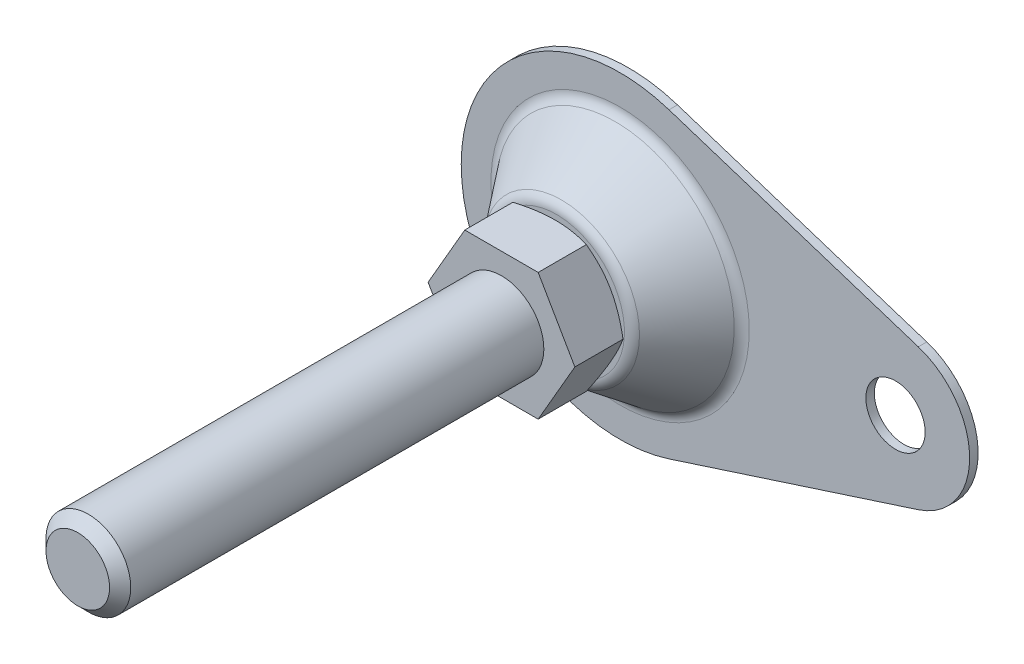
ISO-10303-21;
HEADER;
FILE_DESCRIPTION(('STEP AP214'),'2;1');
FILE_NAME('part.step','',(''),(''),'','','');
FILE_SCHEMA(('AUTOMOTIVE_DESIGN { 1 0 10303 214 1 1 1 1 }'));
ENDSEC;
DATA;
#1=APPLICATION_CONTEXT('core data for automotive mechanical design processes');
#2=APPLICATION_PROTOCOL_DEFINITION('international standard','automotive_design',2000,#1);
#3=PRODUCT_CONTEXT('',#1,'mechanical');
#4=PRODUCT('Part','Part','',(#3));
#5=PRODUCT_RELATED_PRODUCT_CATEGORY('part','',(#4));
#6=PRODUCT_DEFINITION_FORMATION('','',#4);
#7=PRODUCT_DEFINITION_CONTEXT('part definition',#1,'design');
#8=PRODUCT_DEFINITION('design','',#6,#7);
#9=PRODUCT_DEFINITION_SHAPE('','',#8);
#10=(LENGTH_UNIT() NAMED_UNIT(*) SI_UNIT(.MILLI.,.METRE.));
#11=(NAMED_UNIT(*) PLANE_ANGLE_UNIT() SI_UNIT($,.RADIAN.));
#12=(NAMED_UNIT(*) SI_UNIT($,.STERADIAN.) SOLID_ANGLE_UNIT());
#13=UNCERTAINTY_MEASURE_WITH_UNIT(LENGTH_MEASURE(1.E-05),#10,'distance_accuracy_value','');
#14=(GEOMETRIC_REPRESENTATION_CONTEXT(3) GLOBAL_UNCERTAINTY_ASSIGNED_CONTEXT((#13)) GLOBAL_UNIT_ASSIGNED_CONTEXT((#10,
#11,#12)) REPRESENTATION_CONTEXT('',''));
#15=CARTESIAN_POINT('',(0.,0.,0.));
#16=DIRECTION('',(0.,0.,1.));
#17=DIRECTION('',(1.,0.,0.));
#18=AXIS2_PLACEMENT_3D('',#15,#16,#17);
#19=CARTESIAN_POINT('',(65.,0.,2.));
#20=DIRECTION('',(0.,0.,1.));
#21=DIRECTION('',(1.,0.,0.));
#22=AXIS2_PLACEMENT_3D('',#19,#20,#21);
#23=PLANE('',#22);
#24=CARTESIAN_POINT('',(0.,0.,2.));
#25=DIRECTION('',(0.,0.,1.));
#26=DIRECTION('',(1.,0.,0.));
#27=AXIS2_PLACEMENT_3D('',#24,#25,#26);
#28=CIRCLE('',#27,30.4802116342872);
#29=CARTESIAN_POINT('',(30.4802116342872,0.,2.));
#30=VERTEX_POINT('',#29);
#31=EDGE_CURVE('E245',#30,#30,#28,.F.);
#32=ORIENTED_EDGE('',*,*,#31,.T.);
#33=EDGE_LOOP('',(#32));
#34=FACE_BOUND('',#33,.T.);
#35=CARTESIAN_POINT('',(65.,0.,2.));
#36=DIRECTION('',(0.,0.,1.));
#37=DIRECTION('',(1.,0.,0.));
#38=AXIS2_PLACEMENT_3D('',#35,#36,#37);
#39=CIRCLE('',#38,7.);
#40=CARTESIAN_POINT('',(72.,0.,2.));
#41=VERTEX_POINT('',#40);
#42=EDGE_CURVE('E262',#41,#41,#39,.T.);
#43=ORIENTED_EDGE('',*,*,#42,.F.);
#44=EDGE_LOOP('',(#43));
#45=FACE_BOUND('',#44,.T.);
#46=DIRECTION('',(-0.951485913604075,0.307692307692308,0.));
#47=VECTOR('',#46,1.);
#48=CARTESIAN_POINT('',(11.5384615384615,35.6807217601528,2.));
#49=LINE('',#48,#47);
#50=CARTESIAN_POINT('',(70.3846153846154,16.6510034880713,2.));
#51=VERTEX_POINT('',#50);
#52=CARTESIAN_POINT('',(11.5384615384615,35.6807217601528,2.));
#53=VERTEX_POINT('',#52);
#54=EDGE_CURVE('E112',#51,#53,#49,.T.);
#55=ORIENTED_EDGE('',*,*,#54,.T.);
#56=CARTESIAN_POINT('',(0.,0.,2.));
#57=DIRECTION('',(0.,0.,1.));
#58=DIRECTION('',(1.,0.,0.));
#59=AXIS2_PLACEMENT_3D('',#56,#57,#58);
#60=CIRCLE('',#59,37.5);
#61=CARTESIAN_POINT('',(11.5384615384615,-35.6807217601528,2.));
#62=VERTEX_POINT('',#61);
#63=EDGE_CURVE('E114',#53,#62,#60,.T.);
#64=ORIENTED_EDGE('',*,*,#63,.T.);
#65=DIRECTION('',(0.951485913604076,0.307692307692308,0.));
#66=VECTOR('',#65,1.);
#67=CARTESIAN_POINT('',(11.5384615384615,-35.6807217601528,2.));
#68=LINE('',#67,#66);
#69=CARTESIAN_POINT('',(70.3846153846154,-16.6510034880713,2.));
#70=VERTEX_POINT('',#69);
#71=EDGE_CURVE('E97',#62,#70,#68,.T.);
#72=ORIENTED_EDGE('',*,*,#71,.T.);
#73=CARTESIAN_POINT('',(65.,0.,2.));
#74=DIRECTION('',(0.,0.,1.));
#75=DIRECTION('',(1.,0.,0.));
#76=AXIS2_PLACEMENT_3D('',#73,#74,#75);
#77=CIRCLE('',#76,17.5);
#78=EDGE_CURVE('E106',#70,#51,#77,.T.);
#79=ORIENTED_EDGE('',*,*,#78,.T.);
#80=EDGE_LOOP('',(#55,#64,#72,#79));
#81=FACE_BOUND('',#80,.T.);
#82=ADVANCED_FACE('F14',(#34,#45,#81),#23,.T.);
#83=CARTESIAN_POINT('',(65.,0.,0.));
#84=DIRECTION('',(0.,0.,1.));
#85=DIRECTION('',(1.,0.,0.));
#86=AXIS2_PLACEMENT_3D('',#83,#84,#85);
#87=PLANE('',#86);
#88=CARTESIAN_POINT('',(65.,0.,0.));
#89=DIRECTION('',(0.,0.,1.));
#90=DIRECTION('',(1.,0.,0.));
#91=AXIS2_PLACEMENT_3D('',#88,#89,#90);
#92=CIRCLE('',#91,7.);
#93=CARTESIAN_POINT('',(72.,0.,0.));
#94=VERTEX_POINT('',#93);
#95=EDGE_CURVE('E258',#94,#94,#92,.T.);
#96=ORIENTED_EDGE('',*,*,#95,.T.);
#97=EDGE_LOOP('',(#96));
#98=FACE_BOUND('',#97,.T.);
#99=CARTESIAN_POINT('',(0.,0.,0.));
#100=DIRECTION('',(0.,0.,1.));
#101=DIRECTION('',(1.,0.,0.));
#102=AXIS2_PLACEMENT_3D('',#99,#100,#101);
#103=CIRCLE('',#102,37.5);
#104=CARTESIAN_POINT('',(11.5384615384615,35.6807217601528,0.));
#105=VERTEX_POINT('',#104);
#106=CARTESIAN_POINT('',(11.5384615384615,-35.6807217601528,0.));
#107=VERTEX_POINT('',#106);
#108=EDGE_CURVE('E275',#105,#107,#103,.T.);
#109=ORIENTED_EDGE('',*,*,#108,.F.);
#110=DIRECTION('',(-0.951485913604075,0.307692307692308,0.));
#111=VECTOR('',#110,1.);
#112=CARTESIAN_POINT('',(70.3846153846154,16.6510034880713,0.));
#113=LINE('',#112,#111);
#114=CARTESIAN_POINT('',(70.3846153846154,16.6510034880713,0.));
#115=VERTEX_POINT('',#114);
#116=EDGE_CURVE('E9',#115,#105,#113,.T.);
#117=ORIENTED_EDGE('',*,*,#116,.F.);
#118=CARTESIAN_POINT('',(65.,0.,0.));
#119=DIRECTION('',(0.,0.,1.));
#120=DIRECTION('',(1.,0.,0.));
#121=AXIS2_PLACEMENT_3D('',#118,#119,#120);
#122=CIRCLE('',#121,17.5);
#123=CARTESIAN_POINT('',(70.3846153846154,-16.6510034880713,0.));
#124=VERTEX_POINT('',#123);
#125=EDGE_CURVE('E22',#124,#115,#122,.T.);
#126=ORIENTED_EDGE('',*,*,#125,.F.);
#127=DIRECTION('',(0.951485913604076,0.307692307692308,0.));
#128=VECTOR('',#127,1.);
#129=CARTESIAN_POINT('',(70.3846153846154,-16.6510034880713,0.));
#130=LINE('',#129,#128);
#131=EDGE_CURVE('E99',#107,#124,#130,.T.);
#132=ORIENTED_EDGE('',*,*,#131,.F.);
#133=EDGE_LOOP('',(#109,#117,#126,#132));
#134=FACE_BOUND('',#133,.T.);
#135=ADVANCED_FACE('F215',(#98,#134),#87,.F.);
#136=CARTESIAN_POINT('',(0.,0.,17.));
#137=DIRECTION('',(0.,0.,-1.));
#138=DIRECTION('',(-1.,0.,0.));
#139=AXIS2_PLACEMENT_3D('',#136,#137,#138);
#140=PLANE('',#139);
#141=CARTESIAN_POINT('',(0.,0.,17.));
#142=DIRECTION('',(0.,0.,-1.));
#143=DIRECTION('',(-1.,0.,0.));
#144=AXIS2_PLACEMENT_3D('',#141,#142,#143);
#145=CIRCLE('',#144,16.0197883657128);
#146=CARTESIAN_POINT('',(-16.0197883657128,0.,17.));
#147=VERTEX_POINT('',#146);
#148=EDGE_CURVE('E278',#147,#147,#145,.F.);
#149=ORIENTED_EDGE('',*,*,#148,.T.);
#150=EDGE_LOOP('',(#149));
#151=FACE_BOUND('',#150,.T.);
#152=CARTESIAN_POINT('',(0.,0.,17.));
#153=DIRECTION('',(0.,0.,-1.));
#154=DIRECTION('',(-1.,0.,0.));
#155=AXIS2_PLACEMENT_3D('',#152,#153,#154);
#156=CIRCLE('',#155,14.5);
#157=CARTESIAN_POINT('',(-14.5,0.,17.));
#158=VERTEX_POINT('',#157);
#159=EDGE_CURVE('E122',#158,#158,#156,.T.);
#160=ORIENTED_EDGE('',*,*,#159,.T.);
#161=EDGE_LOOP('',(#160));
#162=FACE_BOUND('',#161,.T.);
#163=ADVANCED_FACE('F211',(#151,#162),#140,.F.);
#164=CARTESIAN_POINT('',(0.,0.,5.));
#165=DIRECTION('',(0.,0.,1.));
#166=DIRECTION('',(1.,0.,0.));
#167=AXIS2_PLACEMENT_3D('',#164,#165,#166);
#168=TOROIDAL_SURFACE('',#167,30.4802116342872,3.);
#169=CARTESIAN_POINT('',(0.,0.,3.1747053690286));
#170=DIRECTION('',(0.,0.,1.));
#171=DIRECTION('',(1.,0.,0.));
#172=AXIS2_PLACEMENT_3D('',#169,#170,#171);
#173=CIRCLE('',#172,28.0993925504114);
#174=CARTESIAN_POINT('',(28.0993925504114,0.,3.1747053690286));
#175=VERTEX_POINT('',#174);
#176=EDGE_CURVE('E242',#175,#175,#173,.T.);
#177=ORIENTED_EDGE('',*,*,#176,.F.);
#178=EDGE_LOOP('',(#177));
#179=FACE_BOUND('',#178,.T.);
#180=ORIENTED_EDGE('',*,*,#31,.F.);
#181=EDGE_LOOP('',(#180));
#182=FACE_BOUND('',#181,.T.);
#183=ADVANCED_FACE('F214',(#179,#182),#168,.F.);
#184=CARTESIAN_POINT('',(0.,0.,14.));
#185=DIRECTION('',(0.,0.,-1.));
#186=DIRECTION('',(-1.,0.,0.));
#187=AXIS2_PLACEMENT_3D('',#184,#185,#186);
#188=TOROIDAL_SURFACE('',#187,16.0197883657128,3.);
#189=ORIENTED_EDGE('',*,*,#148,.F.);
#190=EDGE_LOOP('',(#189));
#191=FACE_BOUND('',#190,.T.);
#192=CARTESIAN_POINT('',(0.,0.,15.8252946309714));
#193=DIRECTION('',(0.,0.,1.));
#194=DIRECTION('',(1.,0.,0.));
#195=AXIS2_PLACEMENT_3D('',#192,#193,#194);
#196=CIRCLE('',#195,18.4006074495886);
#197=CARTESIAN_POINT('',(18.4006074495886,0.,15.8252946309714));
#198=VERTEX_POINT('',#197);
#199=EDGE_CURVE('E251',#198,#198,#196,.F.);
#200=ORIENTED_EDGE('',*,*,#199,.F.);
#201=EDGE_LOOP('',(#200));
#202=FACE_BOUND('',#201,.T.);
#203=ADVANCED_FACE('F229',(#191,#202),#188,.T.);
#204=CARTESIAN_POINT('',(0.,0.,2.));
#205=DIRECTION('',(0.,0.,-1.));
#206=DIRECTION('',(-1.,0.,0.));
#207=AXIS2_PLACEMENT_3D('',#204,#205,#206);
#208=CYLINDRICAL_SURFACE('',#207,37.5);
#209=ORIENTED_EDGE('',*,*,#108,.T.);
#210=DIRECTION('',(0.,0.,1.));
#211=VECTOR('',#210,1.);
#212=CARTESIAN_POINT('',(11.5384615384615,-35.6807217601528,-8.));
#213=LINE('',#212,#211);
#214=EDGE_CURVE('E103',#107,#62,#213,.T.);
#215=ORIENTED_EDGE('',*,*,#214,.T.);
#216=ORIENTED_EDGE('',*,*,#63,.F.);
#217=DIRECTION('',(0.,0.,1.));
#218=VECTOR('',#217,1.);
#219=CARTESIAN_POINT('',(11.5384615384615,35.6807217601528,-8.));
#220=LINE('',#219,#218);
#221=EDGE_CURVE('E119',#105,#53,#220,.T.);
#222=ORIENTED_EDGE('',*,*,#221,.F.);
#223=EDGE_LOOP('',(#209,#215,#216,#222));
#224=FACE_BOUND('',#223,.T.);
#225=ADVANCED_FACE('F219',(#224),#208,.T.);
#226=CARTESIAN_POINT('',(65.,0.,2.));
#227=DIRECTION('',(0.,0.,-1.));
#228=DIRECTION('',(-1.,0.,0.));
#229=AXIS2_PLACEMENT_3D('',#226,#227,#228);
#230=CYLINDRICAL_SURFACE('',#229,7.);
#231=ORIENTED_EDGE('',*,*,#42,.T.);
#232=EDGE_LOOP('',(#231));
#233=FACE_BOUND('',#232,.T.);
#234=ORIENTED_EDGE('',*,*,#95,.F.);
#235=EDGE_LOOP('',(#234));
#236=FACE_BOUND('',#235,.T.);
#237=ADVANCED_FACE('F209',(#233,#236),#230,.F.);
#238=CARTESIAN_POINT('',(0.,0.,2.));
#239=DIRECTION('',(0.,0.,-1.));
#240=DIRECTION('',(-1.,0.,0.));
#241=AXIS2_PLACEMENT_3D('',#238,#239,#240);
#242=CONICAL_SURFACE('',#241,29.,0.654082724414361);
#243=ORIENTED_EDGE('',*,*,#176,.T.);
#244=EDGE_LOOP('',(#243));
#245=FACE_BOUND('',#244,.T.);
#246=ORIENTED_EDGE('',*,*,#199,.T.);
#247=EDGE_LOOP('',(#246));
#248=FACE_BOUND('',#247,.T.);
#249=ADVANCED_FACE('F151',(#245,#248),#242,.T.);
#250=CARTESIAN_POINT('',(0.,0.,17.));
#251=DIRECTION('',(0.,0.,1.));
#252=DIRECTION('',(1.,0.,0.));
#253=AXIS2_PLACEMENT_3D('',#250,#251,#252);
#254=CONICAL_SURFACE('',#253,14.5,1.0471975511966);
#255=ORIENTED_EDGE('',*,*,#159,.F.);
#256=EDGE_LOOP('',(#255));
#257=FACE_BOUND('',#256,.T.);
#258=CARTESIAN_POINT('',(17.3206235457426,0.000200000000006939,18.6284877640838));
#259=CARTESIAN_POINT('',(17.130274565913,-0.329494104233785,18.5185969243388));
#260=CARTESIAN_POINT('',(16.939183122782,-0.660474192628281,18.4136927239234));
#261=CARTESIAN_POINT('',(16.5554679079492,-1.325088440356,18.2152437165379));
#262=CARTESIAN_POINT('',(16.3628436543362,-1.65872343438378,18.1217026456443));
#263=CARTESIAN_POINT('',(15.9756905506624,-2.32929228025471,17.9472372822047));
#264=CARTESIAN_POINT('',(15.7811583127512,-2.66623200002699,17.866342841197));
#265=CARTESIAN_POINT('',(15.3907420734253,-3.34245276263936,17.7189077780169));
#266=CARTESIAN_POINT('',(15.1948581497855,-3.68173367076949,17.6523663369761));
#267=CARTESIAN_POINT('',(14.8067578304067,-4.3539431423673,17.5364675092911));
#268=CARTESIAN_POINT('',(14.6145702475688,-4.68682180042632,17.4867265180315));
#269=CARTESIAN_POINT('',(14.2293144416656,-5.35410443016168,17.4033218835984));
#270=CARTESIAN_POINT('',(14.0362462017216,-5.68850843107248,17.3696585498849));
#271=CARTESIAN_POINT('',(13.6497853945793,-6.35787818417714,17.3192592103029));
#272=CARTESIAN_POINT('',(13.4563934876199,-6.69284279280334,17.3025030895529));
#273=CARTESIAN_POINT('',(13.0694311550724,-7.36308121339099,17.2862785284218));
#274=CARTESIAN_POINT('',(12.8758607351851,-7.69835501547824,17.2868095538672));
#275=CARTESIAN_POINT('',(12.5139822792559,-8.3251468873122,17.303951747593));
#276=CARTESIAN_POINT('',(12.3456484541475,-8.61670962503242,17.3184719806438));
#277=CARTESIAN_POINT('',(12.0093680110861,-9.19916443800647,17.3603122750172));
#278=CARTESIAN_POINT('',(11.8414214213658,-9.49005646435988,17.3876332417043));
#279=CARTESIAN_POINT('',(11.5060066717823,-10.0710118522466,17.4545986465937));
#280=CARTESIAN_POINT('',(11.338539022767,-10.3610743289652,17.4942532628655));
#281=CARTESIAN_POINT('',(11.0043888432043,-10.939839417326,17.5851902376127));
#282=CARTESIAN_POINT('',(10.8377063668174,-11.2285419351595,17.6364733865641));
#283=CARTESIAN_POINT('',(10.3317324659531,-12.1049144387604,17.8090619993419));
#284=CARTESIAN_POINT('',(9.99390625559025,-12.6900465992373,17.9475763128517));
#285=CARTESIAN_POINT('',(9.32329122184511,-13.8515859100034,18.26194710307));
#286=CARTESIAN_POINT('',(8.99049381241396,-14.4280079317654,18.4377297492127));
#287=CARTESIAN_POINT('',(8.66013856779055,-15.0002,18.6284877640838));
#288=B_SPLINE_CURVE_WITH_KNOTS('',3,(#258,#259,#260,#261,#262,#263,#264,#265,#266,#267,#268,
#269,#270,#271,#272,#273,#274,#275,#276,#277,#278,#279,#280,#281,#282,#283,#284,#285,#286,#287),
.UNSPECIFIED.,.F.,.F.,(4,2,2,2,2,2,2,2,2,2,2,2,2,2,4),(0.,1.18875411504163,2.37789802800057,
3.56980778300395,4.76164951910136,5.92407379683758,7.08652044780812,8.24758247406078,
9.40860862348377,10.4193068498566,11.4300765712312,12.4416826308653,13.4533574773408,
15.5211962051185,17.5849760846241),.UNSPECIFIED.);
#289=CARTESIAN_POINT('',(17.3205080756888,0.,18.6284210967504));
#290=VERTEX_POINT('',#289);
#291=CARTESIAN_POINT('',(8.66025403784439,-15.,18.6284210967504));
#292=VERTEX_POINT('',#291);
#293=EDGE_CURVE('E29',#290,#292,#288,.T.);
#294=ORIENTED_EDGE('',*,*,#293,.T.);
#295=CARTESIAN_POINT('',(-23.3071241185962,-15.,24.6307337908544));
#296=CARTESIAN_POINT('',(-22.9793195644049,-15.,24.4715894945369));
#297=CARTESIAN_POINT('',(-22.6511314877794,-15.,24.3132355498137));
#298=CARTESIAN_POINT('',(-21.993908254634,-15.,23.9982873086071));
#299=CARTESIAN_POINT('',(-21.6648730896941,-15.,23.8416930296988));
#300=CARTESIAN_POINT('',(-20.6762898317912,-15.,23.3747770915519));
#301=CARTESIAN_POINT('',(-20.015360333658,-15.,23.067369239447));
#302=CARTESIAN_POINT('',(-18.6855179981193,-15.,22.4605298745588));
#303=CARTESIAN_POINT('',(-18.0165813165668,-15.,22.1611504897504));
#304=CARTESIAN_POINT('',(-16.6734024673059,-15.,21.574582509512));
#305=CARTESIAN_POINT('',(-15.9991605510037,-15.,21.2873933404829));
#306=CARTESIAN_POINT('',(-14.6225897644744,-15.,20.7194747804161));
#307=CARTESIAN_POINT('',(-13.9200529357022,-15.,20.4392468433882));
#308=CARTESIAN_POINT('',(-12.5067723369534,-15.,19.8998908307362));
#309=CARTESIAN_POINT('',(-11.7960276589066,-15.,19.6407651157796));
#310=CARTESIAN_POINT('',(-10.3665384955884,-15.,19.1503856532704));
#311=CARTESIAN_POINT('',(-9.64781336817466,-15.,18.9190759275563));
#312=CARTESIAN_POINT('',(-8.19998683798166,-15.,18.4917069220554));
#313=CARTESIAN_POINT('',(-7.47088876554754,-15.,18.2956365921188));
#314=CARTESIAN_POINT('',(-6.37129020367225,-15.,18.0355539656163));
#315=CARTESIAN_POINT('',(-6.00474916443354,-15.,17.9547006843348));
#316=CARTESIAN_POINT('',(-5.26915421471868,-15.,17.8053024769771));
#317=CARTESIAN_POINT('',(-4.9001003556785,-15.,17.7367572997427));
#318=CARTESIAN_POINT('',(-4.15973142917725,-15.,17.6131825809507));
#319=CARTESIAN_POINT('',(-3.7884163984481,-15.,17.5581528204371));
#320=CARTESIAN_POINT('',(-3.0439161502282,-15.,17.4627051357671));
#321=CARTESIAN_POINT('',(-2.67073101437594,-15.,17.4222865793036));
#322=CARTESIAN_POINT('',(-1.92790511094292,-15.,17.3573734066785));
#323=CARTESIAN_POINT('',(-1.55828210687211,-15.,17.3326767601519));
#324=CARTESIAN_POINT('',(-0.818323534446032,-15.,17.298938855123));
#325=CARTESIAN_POINT('',(-0.447987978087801,-15.,17.2898973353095));
#326=CARTESIAN_POINT('',(0.292737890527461,-15.,17.287684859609));
#327=CARTESIAN_POINT('',(0.663128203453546,-15.,17.2945141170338));
#328=CARTESIAN_POINT('',(1.40328993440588,-15.,17.3238764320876));
#329=CARTESIAN_POINT('',(1.77306132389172,-15.,17.3464101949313));
#330=CARTESIAN_POINT('',(2.66018585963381,-15.,17.4188312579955));
#331=CARTESIAN_POINT('',(3.17694844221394,-15.,17.4760830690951));
#332=CARTESIAN_POINT('',(4.20667255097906,-15.,17.6181529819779));
#333=CARTESIAN_POINT('',(4.7196335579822,-15.,17.7029747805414));
#334=CARTESIAN_POINT('',(5.74124541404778,-15.,17.8971676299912));
#335=CARTESIAN_POINT('',(6.24989270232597,-15.,18.0065572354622));
#336=CARTESIAN_POINT('',(7.26210328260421,-15.,18.2465480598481));
#337=CARTESIAN_POINT('',(7.76566664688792,-15.,18.3771489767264));
#338=CARTESIAN_POINT('',(8.77921433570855,-15.,18.659590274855));
#339=CARTESIAN_POINT('',(9.28908131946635,-15.,18.8118488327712));
#340=CARTESIAN_POINT('',(10.303790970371,-15.,19.1321926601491));
#341=CARTESIAN_POINT('',(10.80863360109,-15.,19.3002780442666));
#342=CARTESIAN_POINT('',(11.813548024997,-15.,19.6495976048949));
#343=CARTESIAN_POINT('',(12.3136212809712,-15.,19.8308275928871));
#344=CARTESIAN_POINT('',(13.309611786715,-15.,20.2042942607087));
#345=CARTESIAN_POINT('',(13.8055291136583,-15.,20.3965307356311));
#346=CARTESIAN_POINT('',(15.0860229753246,-15.,20.9066309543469));
#347=CARTESIAN_POINT('',(15.8677938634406,-15.,21.2315314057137));
#348=CARTESIAN_POINT('',(17.423816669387,-15.,21.8989223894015));
#349=CARTESIAN_POINT('',(18.1980678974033,-15.,22.2414145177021));
#350=CARTESIAN_POINT('',(19.740678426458,-15.,22.9400194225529));
#351=CARTESIAN_POINT('',(20.5090357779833,-15.,23.296136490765));
#352=CARTESIAN_POINT('',(22.0407406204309,-15.,24.0188907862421));
#353=CARTESIAN_POINT('',(22.8040882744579,-15.,24.3855276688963));
#354=CARTESIAN_POINT('',(24.327782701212,-15.,25.1276485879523));
#355=CARTESIAN_POINT('',(25.088123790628,-15.,25.503144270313));
#356=CARTESIAN_POINT('',(26.6054631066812,-15.,26.2608320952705));
#357=CARTESIAN_POINT('',(27.3624613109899,-15.,26.6430242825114));
#358=CARTESIAN_POINT('',(28.8735511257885,-15.,27.4127721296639));
#359=CARTESIAN_POINT('',(29.6276432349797,-15.,27.8003268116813));
#360=CARTESIAN_POINT('',(31.1335111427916,-15.,28.5799008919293));
#361=CARTESIAN_POINT('',(31.8852869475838,-15.,28.9719202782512));
#362=CARTESIAN_POINT('',(33.9901583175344,-15.,30.0761080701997));
#363=CARTESIAN_POINT('',(35.3410738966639,-15.,30.7924314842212));
#364=CARTESIAN_POINT('',(38.0382840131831,-15.,32.2338698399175));
#365=CARTESIAN_POINT('',(39.384578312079,-15.,32.9589852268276));
#366=CARTESIAN_POINT('',(42.069570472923,-15.,34.413650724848));
#367=CARTESIAN_POINT('',(43.4082790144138,-15.,35.1431811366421));
#368=CARTESIAN_POINT('',(45.4142122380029,-15.,36.2412549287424));
#369=CARTESIAN_POINT('',(46.0824792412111,-15.,36.6078968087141));
#370=CARTESIAN_POINT('',(47.4183912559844,-15.,37.3423100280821));
#371=CARTESIAN_POINT('',(48.0860362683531,-15.,37.7100813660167));
#372=CARTESIAN_POINT('',(48.7534075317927,-15.,38.0783489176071));
#373=B_SPLINE_CURVE_WITH_KNOTS('',3,(#295,#296,#297,#298,#299,#300,#301,#302,#303,#304,#305,
#306,#307,#308,#309,#310,#311,#312,#313,#314,#315,#316,#317,#318,#319,#320,#321,#322,#323,#324,
#325,#326,#327,#328,#329,#330,#331,#332,#333,#334,#335,#336,#337,#338,#339,#340,#341,#342,#343,
#344,#345,#346,#347,#348,#349,#350,#351,#352,#353,#354,#355,#356,#357,#358,#359,#360,#361,#362,
#363,#364,#365,#366,#367,#368,#369,#370,#371,#372),.UNSPECIFIED.,.F.,.F.,(4,2,2,2,2,2,2,2,2,2,2,
2,2,2,2,2,2,2,2,2,2,2,2,2,2,2,2,2,2,2,2,2,2,2,2,2,2,2,4),(0.,1.09317898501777,2.18636887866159,
4.37307015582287,6.57159737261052,8.77002102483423,11.0388525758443,13.307937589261,
15.5723769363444,17.8361049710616,18.9619895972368,20.0878512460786,21.2136946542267,
22.3394893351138,23.450508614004,24.5615093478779,25.6725250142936,26.7835905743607,
28.3425027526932,29.9016240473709,31.4619268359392,33.0222074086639,34.6182471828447,
36.2142985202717,37.8098434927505,39.4053587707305,41.944834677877,44.484541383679,
47.0250547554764,49.5654849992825,52.1094648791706,54.6534617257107,57.197000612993,
59.7405327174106,64.327728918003,68.9151583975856,73.4888940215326,75.7756077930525,
78.0623186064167),.UNSPECIFIED.);
#374=CARTESIAN_POINT('',(-8.6602540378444,-15.,18.6284210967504));
#375=VERTEX_POINT('',#374);
#376=EDGE_CURVE('E158',#292,#375,#373,.F.);
#377=ORIENTED_EDGE('',*,*,#376,.T.);
#378=CARTESIAN_POINT('',(-8.66013856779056,-15.0002,18.6284877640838));
#379=CARTESIAN_POINT('',(-8.85048754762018,-14.6705058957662,18.5185969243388));
#380=CARTESIAN_POINT('',(-9.04157899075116,-14.3395258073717,18.4136927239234));
#381=CARTESIAN_POINT('',(-9.42529420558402,-13.674911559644,18.2152437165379));
#382=CARTESIAN_POINT('',(-9.61791845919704,-13.3412765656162,18.1217026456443));
#383=CARTESIAN_POINT('',(-10.0050715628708,-12.6707077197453,17.9472372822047));
#384=CARTESIAN_POINT('',(-10.199603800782,-12.333767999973,17.866342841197));
#385=CARTESIAN_POINT('',(-10.5900200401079,-11.6575472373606,17.7189077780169));
#386=CARTESIAN_POINT('',(-10.7859039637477,-11.3182663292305,17.6523663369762));
#387=CARTESIAN_POINT('',(-11.1740042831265,-10.6460568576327,17.5364675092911));
#388=CARTESIAN_POINT('',(-11.3661918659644,-10.3131781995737,17.4867265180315));
#389=CARTESIAN_POINT('',(-11.7514476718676,-9.64589556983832,17.4033218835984));
#390=CARTESIAN_POINT('',(-11.9445159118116,-9.31149156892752,17.3696585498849));
#391=CARTESIAN_POINT('',(-12.3309767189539,-8.64212181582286,17.3192592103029));
#392=CARTESIAN_POINT('',(-12.5243686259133,-8.30715720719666,17.3025030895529));
#393=CARTESIAN_POINT('',(-12.9113309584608,-7.63691878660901,17.2862785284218));
#394=CARTESIAN_POINT('',(-13.1049013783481,-7.30164498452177,17.2868095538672));
#395=CARTESIAN_POINT('',(-13.4667798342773,-6.67485311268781,17.303951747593));
#396=CARTESIAN_POINT('',(-13.6351136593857,-6.38329037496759,17.3184719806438));
#397=CARTESIAN_POINT('',(-13.9713941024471,-5.80083556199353,17.3603122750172));
#398=CARTESIAN_POINT('',(-14.1393406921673,-5.50994353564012,17.3876332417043));
#399=CARTESIAN_POINT('',(-14.4747554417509,-4.92898814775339,17.4545986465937));
#400=CARTESIAN_POINT('',(-14.6422230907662,-4.63892567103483,17.4942532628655));
#401=CARTESIAN_POINT('',(-14.9763732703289,-4.06016058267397,17.5851902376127));
#402=CARTESIAN_POINT('',(-15.1430557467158,-3.77145806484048,17.6364733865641));
#403=CARTESIAN_POINT('',(-15.6490296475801,-2.8950855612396,17.8090619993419));
#404=CARTESIAN_POINT('',(-15.9868558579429,-2.30995340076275,17.9475763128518));
#405=CARTESIAN_POINT('',(-16.6574708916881,-1.14841408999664,18.26194710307));
#406=CARTESIAN_POINT('',(-16.9902683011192,-0.571992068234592,18.4377297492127));
#407=CARTESIAN_POINT('',(-17.3206235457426,0.000199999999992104,18.6284877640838));
#408=B_SPLINE_CURVE_WITH_KNOTS('',3,(#378,#379,#380,#381,#382,#383,#384,#385,#386,#387,#388,
#389,#390,#391,#392,#393,#394,#395,#396,#397,#398,#399,#400,#401,#402,#403,#404,#405,#406,#407),
.UNSPECIFIED.,.F.,.F.,(4,2,2,2,2,2,2,2,2,2,2,2,2,2,4),(0.,1.18875411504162,2.37789802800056,
3.56980778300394,4.76164951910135,5.92407379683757,7.0865204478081,8.24758247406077,
9.40860862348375,10.4193068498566,11.4300765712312,12.4416826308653,13.4533574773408,
15.5211962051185,17.5849760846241),.UNSPECIFIED.);
#409=CARTESIAN_POINT('',(-17.3205080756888,0.,18.6284210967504));
#410=VERTEX_POINT('',#409);
#411=EDGE_CURVE('E127',#375,#410,#408,.T.);
#412=ORIENTED_EDGE('',*,*,#411,.T.);
#413=CARTESIAN_POINT('',(-17.3206235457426,-0.000200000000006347,18.6284877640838));
#414=CARTESIAN_POINT('',(-17.130274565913,0.329494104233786,18.5185969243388));
#415=CARTESIAN_POINT('',(-16.939183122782,0.660474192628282,18.4136927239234));
#416=CARTESIAN_POINT('',(-16.5554679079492,1.325088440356,18.2152437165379));
#417=CARTESIAN_POINT('',(-16.3628436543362,1.65872343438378,18.1217026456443));
#418=CARTESIAN_POINT('',(-15.9756905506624,2.32929228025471,17.9472372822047));
#419=CARTESIAN_POINT('',(-15.7811583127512,2.666232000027,17.866342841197));
#420=CARTESIAN_POINT('',(-15.3907420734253,3.34245276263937,17.7189077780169));
#421=CARTESIAN_POINT('',(-15.1948581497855,3.6817336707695,17.6523663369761));
#422=CARTESIAN_POINT('',(-14.8067578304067,4.3539431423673,17.5364675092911));
#423=CARTESIAN_POINT('',(-14.6145702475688,4.68682180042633,17.4867265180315));
#424=CARTESIAN_POINT('',(-14.2293144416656,5.35410443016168,17.4033218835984));
#425=CARTESIAN_POINT('',(-14.0362462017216,5.68850843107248,17.3696585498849));
#426=CARTESIAN_POINT('',(-13.6497853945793,6.35787818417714,17.3192592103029));
#427=CARTESIAN_POINT('',(-13.4563934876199,6.69284279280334,17.3025030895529));
#428=CARTESIAN_POINT('',(-13.0694311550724,7.363081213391,17.2862785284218));
#429=CARTESIAN_POINT('',(-12.8758607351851,7.69835501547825,17.2868095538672));
#430=CARTESIAN_POINT('',(-12.5139822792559,8.3251468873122,17.303951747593));
#431=CARTESIAN_POINT('',(-12.3456484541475,8.61670962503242,17.3184719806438));
#432=CARTESIAN_POINT('',(-12.0093680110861,9.19916443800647,17.3603122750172));
#433=CARTESIAN_POINT('',(-11.8414214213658,9.49005646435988,17.3876332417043));
#434=CARTESIAN_POINT('',(-11.5060066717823,10.0710118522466,17.4545986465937));
#435=CARTESIAN_POINT('',(-11.338539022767,10.3610743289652,17.4942532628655));
#436=CARTESIAN_POINT('',(-11.0043888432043,10.939839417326,17.5851902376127));
#437=CARTESIAN_POINT('',(-10.8377063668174,11.2285419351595,17.6364733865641));
#438=CARTESIAN_POINT('',(-10.3317324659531,12.1049144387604,17.8090619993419));
#439=CARTESIAN_POINT('',(-9.99390625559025,12.6900465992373,17.9475763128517));
#440=CARTESIAN_POINT('',(-9.32329122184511,13.8515859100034,18.26194710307));
#441=CARTESIAN_POINT('',(-8.99049381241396,14.4280079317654,18.4377297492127));
#442=CARTESIAN_POINT('',(-8.66013856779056,15.0002,18.6284877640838));
#443=B_SPLINE_CURVE_WITH_KNOTS('',3,(#413,#414,#415,#416,#417,#418,#419,#420,#421,#422,#423,
#424,#425,#426,#427,#428,#429,#430,#431,#432,#433,#434,#435,#436,#437,#438,#439,#440,#441,#442),
.UNSPECIFIED.,.F.,.F.,(4,2,2,2,2,2,2,2,2,2,2,2,2,2,4),(0.,1.18875411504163,2.37789802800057,
3.56980778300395,4.76164951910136,5.92407379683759,7.08652044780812,8.24758247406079,
9.40860862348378,10.4193068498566,11.4300765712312,12.4416826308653,13.4533574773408,
15.5211962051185,17.5849760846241),.UNSPECIFIED.);
#444=CARTESIAN_POINT('',(-8.66025403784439,15.,18.6284210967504));
#445=VERTEX_POINT('',#444);
#446=EDGE_CURVE('E135',#410,#445,#443,.T.);
#447=ORIENTED_EDGE('',*,*,#446,.T.);
#448=CARTESIAN_POINT('',(-23.3071241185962,15.,24.6307337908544));
#449=CARTESIAN_POINT('',(-22.979319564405,15.,24.4715894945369));
#450=CARTESIAN_POINT('',(-22.6511314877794,15.,24.3132355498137));
#451=CARTESIAN_POINT('',(-21.9939082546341,15.,23.9982873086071));
#452=CARTESIAN_POINT('',(-21.6648730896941,15.,23.8416930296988));
#453=CARTESIAN_POINT('',(-20.6762898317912,15.,23.3747770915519));
#454=CARTESIAN_POINT('',(-20.015360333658,15.,23.067369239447));
#455=CARTESIAN_POINT('',(-18.6855179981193,15.,22.4605298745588));
#456=CARTESIAN_POINT('',(-18.0165813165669,15.,22.1611504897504));
#457=CARTESIAN_POINT('',(-16.6734024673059,15.,21.574582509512));
#458=CARTESIAN_POINT('',(-15.9991605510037,15.,21.2873933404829));
#459=CARTESIAN_POINT('',(-14.6225897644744,15.,20.7194747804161));
#460=CARTESIAN_POINT('',(-13.9200529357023,15.,20.4392468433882));
#461=CARTESIAN_POINT('',(-12.5067723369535,15.,19.8998908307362));
#462=CARTESIAN_POINT('',(-11.7960276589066,15.,19.6407651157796));
#463=CARTESIAN_POINT('',(-10.3665384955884,15.,19.1503856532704));
#464=CARTESIAN_POINT('',(-9.64781336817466,15.,18.9190759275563));
#465=CARTESIAN_POINT('',(-8.19998683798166,15.,18.4917069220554));
#466=CARTESIAN_POINT('',(-7.47088876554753,15.,18.2956365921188));
#467=CARTESIAN_POINT('',(-6.37129020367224,15.,18.0355539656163));
#468=CARTESIAN_POINT('',(-6.00474916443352,15.,17.9547006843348));
#469=CARTESIAN_POINT('',(-5.26915421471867,15.,17.8053024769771));
#470=CARTESIAN_POINT('',(-4.90010035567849,15.,17.7367572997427));
#471=CARTESIAN_POINT('',(-4.15973142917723,15.,17.6131825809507));
#472=CARTESIAN_POINT('',(-3.78841639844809,15.,17.5581528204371));
#473=CARTESIAN_POINT('',(-3.04391615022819,15.,17.4627051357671));
#474=CARTESIAN_POINT('',(-2.67073101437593,15.,17.4222865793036));
#475=CARTESIAN_POINT('',(-1.92790511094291,15.,17.3573734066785));
#476=CARTESIAN_POINT('',(-1.5582821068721,15.,17.3326767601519));
#477=CARTESIAN_POINT('',(-0.818323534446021,15.,17.298938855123));
#478=CARTESIAN_POINT('',(-0.44798797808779,15.,17.2898973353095));
#479=CARTESIAN_POINT('',(0.292737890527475,15.,17.287684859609));
#480=CARTESIAN_POINT('',(0.66312820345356,15.,17.2945141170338));
#481=CARTESIAN_POINT('',(1.40328993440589,15.,17.3238764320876));
#482=CARTESIAN_POINT('',(1.77306132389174,15.,17.3464101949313));
#483=CARTESIAN_POINT('',(2.66018585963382,15.,17.4188312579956));
#484=CARTESIAN_POINT('',(3.17694844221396,15.,17.4760830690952));
#485=CARTESIAN_POINT('',(4.20667255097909,15.,17.6181529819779));
#486=CARTESIAN_POINT('',(4.71963355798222,15.,17.7029747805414));
#487=CARTESIAN_POINT('',(5.74124541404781,15.,17.8971676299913));
#488=CARTESIAN_POINT('',(6.24989270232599,15.,18.0065572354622));
#489=CARTESIAN_POINT('',(7.26210328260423,15.,18.2465480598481));
#490=CARTESIAN_POINT('',(7.76566664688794,15.,18.3771489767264));
#491=CARTESIAN_POINT('',(8.77921433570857,15.,18.659590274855));
#492=CARTESIAN_POINT('',(9.28908131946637,15.,18.8118488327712));
#493=CARTESIAN_POINT('',(10.303790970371,15.,19.1321926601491));
#494=CARTESIAN_POINT('',(10.80863360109,15.,19.3002780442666));
#495=CARTESIAN_POINT('',(11.813548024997,15.,19.6495976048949));
#496=CARTESIAN_POINT('',(12.3136212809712,15.,19.8308275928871));
#497=CARTESIAN_POINT('',(13.309611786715,15.,20.2042942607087));
#498=CARTESIAN_POINT('',(13.8055291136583,15.,20.3965307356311));
#499=CARTESIAN_POINT('',(15.0860229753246,15.,20.9066309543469));
#500=CARTESIAN_POINT('',(15.8677938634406,15.,21.2315314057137));
#501=CARTESIAN_POINT('',(17.423816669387,15.,21.8989223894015));
#502=CARTESIAN_POINT('',(18.1980678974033,15.,22.2414145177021));
#503=CARTESIAN_POINT('',(19.740678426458,15.,22.9400194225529));
#504=CARTESIAN_POINT('',(20.5090357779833,15.,23.296136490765));
#505=CARTESIAN_POINT('',(22.0407406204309,15.,24.0188907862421));
#506=CARTESIAN_POINT('',(22.8040882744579,15.,24.3855276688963));
#507=CARTESIAN_POINT('',(24.327782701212,15.,25.1276485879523));
#508=CARTESIAN_POINT('',(25.088123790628,15.,25.503144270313));
#509=CARTESIAN_POINT('',(26.6054631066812,15.,26.2608320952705));
#510=CARTESIAN_POINT('',(27.3624613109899,15.,26.6430242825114));
#511=CARTESIAN_POINT('',(28.8735511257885,15.,27.4127721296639));
#512=CARTESIAN_POINT('',(29.6276432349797,15.,27.8003268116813));
#513=CARTESIAN_POINT('',(31.1335111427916,15.,28.5799008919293));
#514=CARTESIAN_POINT('',(31.8852869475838,15.,28.9719202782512));
#515=CARTESIAN_POINT('',(33.9901583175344,15.,30.0761080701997));
#516=CARTESIAN_POINT('',(35.3410738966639,15.,30.7924314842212));
#517=CARTESIAN_POINT('',(38.0382840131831,15.,32.2338698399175));
#518=CARTESIAN_POINT('',(39.384578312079,15.,32.9589852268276));
#519=CARTESIAN_POINT('',(42.069570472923,15.,34.413650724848));
#520=CARTESIAN_POINT('',(43.4082790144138,15.,35.1431811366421));
#521=CARTESIAN_POINT('',(45.4142122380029,15.,36.2412549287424));
#522=CARTESIAN_POINT('',(46.0824792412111,15.,36.6078968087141));
#523=CARTESIAN_POINT('',(47.4183912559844,15.,37.3423100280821));
#524=CARTESIAN_POINT('',(48.0860362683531,15.,37.7100813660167));
#525=CARTESIAN_POINT('',(48.7534075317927,15.,38.0783489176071));
#526=B_SPLINE_CURVE_WITH_KNOTS('',3,(#448,#449,#450,#451,#452,#453,#454,#455,#456,#457,#458,
#459,#460,#461,#462,#463,#464,#465,#466,#467,#468,#469,#470,#471,#472,#473,#474,#475,#476,#477,
#478,#479,#480,#481,#482,#483,#484,#485,#486,#487,#488,#489,#490,#491,#492,#493,#494,#495,#496,
#497,#498,#499,#500,#501,#502,#503,#504,#505,#506,#507,#508,#509,#510,#511,#512,#513,#514,#515,
#516,#517,#518,#519,#520,#521,#522,#523,#524,#525),.UNSPECIFIED.,.F.,.F.,(4,2,2,2,2,2,2,2,2,2,2,
2,2,2,2,2,2,2,2,2,2,2,2,2,2,2,2,2,2,2,2,2,2,2,2,2,2,2,4),(0.,1.09317898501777,2.18636887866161,
4.3730701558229,6.57159737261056,8.77002102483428,11.0388525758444,13.3079375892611,
15.5723769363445,17.8361049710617,18.9619895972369,20.0878512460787,21.2136946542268,
22.3394893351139,23.4505086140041,24.561509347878,25.6725250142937,26.7835905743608,
28.3425027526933,29.901624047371,31.4619268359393,33.022207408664,34.6182471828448,
36.2142985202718,37.8098434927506,39.4053587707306,41.9448346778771,44.4845413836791,
47.0250547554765,49.5654849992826,52.1094648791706,54.6534617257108,57.1970006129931,
59.7405327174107,64.3277289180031,68.9151583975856,73.4888940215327,75.7756077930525,
78.0623186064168),.UNSPECIFIED.);
#527=CARTESIAN_POINT('',(8.66025403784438,15.,18.6284210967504));
#528=VERTEX_POINT('',#527);
#529=EDGE_CURVE('E169',#445,#528,#526,.T.);
#530=ORIENTED_EDGE('',*,*,#529,.T.);
#531=CARTESIAN_POINT('',(8.66013856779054,15.0002,18.6284877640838));
#532=CARTESIAN_POINT('',(8.85048754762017,14.6705058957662,18.5185969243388));
#533=CARTESIAN_POINT('',(9.04157899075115,14.3395258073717,18.4136927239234));
#534=CARTESIAN_POINT('',(9.42529420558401,13.674911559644,18.2152437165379));
#535=CARTESIAN_POINT('',(9.61791845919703,13.3412765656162,18.1217026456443));
#536=CARTESIAN_POINT('',(10.0050715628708,12.6707077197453,17.9472372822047));
#537=CARTESIAN_POINT('',(10.199603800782,12.333767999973,17.866342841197));
#538=CARTESIAN_POINT('',(10.5900200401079,11.6575472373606,17.7189077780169));
#539=CARTESIAN_POINT('',(10.7859039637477,11.3182663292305,17.6523663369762));
#540=CARTESIAN_POINT('',(11.1740042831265,10.6460568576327,17.5364675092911));
#541=CARTESIAN_POINT('',(11.3661918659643,10.3131781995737,17.4867265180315));
#542=CARTESIAN_POINT('',(11.7514476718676,9.64589556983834,17.4033218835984));
#543=CARTESIAN_POINT('',(11.9445159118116,9.31149156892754,17.3696585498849));
#544=CARTESIAN_POINT('',(12.3309767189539,8.64212181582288,17.3192592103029));
#545=CARTESIAN_POINT('',(12.5243686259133,8.30715720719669,17.3025030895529));
#546=CARTESIAN_POINT('',(12.9113309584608,7.63691878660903,17.2862785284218));
#547=CARTESIAN_POINT('',(13.104901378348,7.30164498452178,17.2868095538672));
#548=CARTESIAN_POINT('',(13.4667798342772,6.67485311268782,17.303951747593));
#549=CARTESIAN_POINT('',(13.6351136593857,6.38329037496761,17.3184719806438));
#550=CARTESIAN_POINT('',(13.9713941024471,5.80083556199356,17.3603122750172));
#551=CARTESIAN_POINT('',(14.1393406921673,5.50994353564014,17.3876332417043));
#552=CARTESIAN_POINT('',(14.4747554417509,4.92898814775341,17.4545986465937));
#553=CARTESIAN_POINT('',(14.6422230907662,4.63892567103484,17.4942532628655));
#554=CARTESIAN_POINT('',(14.9763732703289,4.06016058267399,17.5851902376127));
#555=CARTESIAN_POINT('',(15.1430557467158,3.77145806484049,17.6364733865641));
#556=CARTESIAN_POINT('',(15.6490296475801,2.89508556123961,17.8090619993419));
#557=CARTESIAN_POINT('',(15.9868558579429,2.30995340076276,17.9475763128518));
#558=CARTESIAN_POINT('',(16.6574708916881,1.14841408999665,18.26194710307));
#559=CARTESIAN_POINT('',(16.9902683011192,0.571992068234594,18.4377297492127));
#560=CARTESIAN_POINT('',(17.3206235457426,-0.000199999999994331,18.6284877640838));
#561=B_SPLINE_CURVE_WITH_KNOTS('',3,(#531,#532,#533,#534,#535,#536,#537,#538,#539,#540,#541,
#542,#543,#544,#545,#546,#547,#548,#549,#550,#551,#552,#553,#554,#555,#556,#557,#558,#559,#560),
.UNSPECIFIED.,.F.,.F.,(4,2,2,2,2,2,2,2,2,2,2,2,2,2,4),(0.,1.18875411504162,2.37789802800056,
3.56980778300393,4.76164951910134,5.92407379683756,7.08652044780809,8.24758247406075,
9.40860862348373,10.4193068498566,11.4300765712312,12.4416826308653,13.4533574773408,
15.5211962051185,17.5849760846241),.UNSPECIFIED.);
#562=EDGE_CURVE('E176',#528,#290,#561,.T.);
#563=ORIENTED_EDGE('',*,*,#562,.T.);
#564=EDGE_LOOP('',(#294,#377,#412,#447,#530,#563));
#565=FACE_BOUND('',#564,.T.);
#566=ADVANCED_FACE('F145',(#257,#565),#254,.T.);
#567=CARTESIAN_POINT('',(0.,0.,130.));
#568=DIRECTION('',(0.,0.,1.));
#569=DIRECTION('',(1.,0.,0.));
#570=AXIS2_PLACEMENT_3D('',#567,#568,#569);
#571=PLANE('',#570);
#572=CARTESIAN_POINT('',(0.,0.,130.));
#573=DIRECTION('',(0.,0.,1.));
#574=DIRECTION('',(1.,0.,0.));
#575=AXIS2_PLACEMENT_3D('',#572,#573,#574);
#576=CIRCLE('',#575,7.5);
#577=CARTESIAN_POINT('',(7.5,0.,130.));
#578=VERTEX_POINT('',#577);
#579=EDGE_CURVE('E246',#578,#578,#576,.T.);
#580=ORIENTED_EDGE('',*,*,#579,.T.);
#581=EDGE_LOOP('',(#580));
#582=FACE_BOUND('',#581,.T.);
#583=ADVANCED_FACE('F150',(#582),#571,.T.);
#584=CARTESIAN_POINT('',(0.,0.,130.));
#585=DIRECTION('',(0.,0.,-1.));
#586=DIRECTION('',(-1.,0.,0.));
#587=AXIS2_PLACEMENT_3D('',#584,#585,#586);
#588=CONICAL_SURFACE('',#587,7.5,0.785398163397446);
#589=CARTESIAN_POINT('',(0.,0.,127.5));
#590=DIRECTION('',(0.,0.,1.));
#591=DIRECTION('',(1.,0.,0.));
#592=AXIS2_PLACEMENT_3D('',#589,#590,#591);
#593=CIRCLE('',#592,10.);
#594=CARTESIAN_POINT('',(10.,0.,127.5));
#595=VERTEX_POINT('',#594);
#596=EDGE_CURVE('E249',#595,#595,#593,.F.);
#597=ORIENTED_EDGE('',*,*,#596,.F.);
#598=EDGE_LOOP('',(#597));
#599=FACE_BOUND('',#598,.T.);
#600=ORIENTED_EDGE('',*,*,#579,.F.);
#601=EDGE_LOOP('',(#600));
#602=FACE_BOUND('',#601,.T.);
#603=ADVANCED_FACE('F16',(#599,#602),#588,.T.);
#604=CARTESIAN_POINT('',(0.,0.,130.));
#605=DIRECTION('',(0.,0.,-1.));
#606=DIRECTION('',(-1.,0.,0.));
#607=AXIS2_PLACEMENT_3D('',#604,#605,#606);
#608=CYLINDRICAL_SURFACE('',#607,10.);
#609=CARTESIAN_POINT('',(0.,0.,30.));
#610=DIRECTION('',(0.,0.,1.));
#611=DIRECTION('',(1.,0.,0.));
#612=AXIS2_PLACEMENT_3D('',#609,#610,#611);
#613=CIRCLE('',#612,10.);
#614=CARTESIAN_POINT('',(10.,0.,30.));
#615=VERTEX_POINT('',#614);
#616=EDGE_CURVE('E256',#615,#615,#613,.T.);
#617=ORIENTED_EDGE('',*,*,#616,.T.);
#618=EDGE_LOOP('',(#617));
#619=FACE_BOUND('',#618,.T.);
#620=ORIENTED_EDGE('',*,*,#596,.T.);
#621=EDGE_LOOP('',(#620));
#622=FACE_BOUND('',#621,.T.);
#623=ADVANCED_FACE('F203',(#619,#622),#608,.T.);
#624=CARTESIAN_POINT('',(0.,0.,30.));
#625=DIRECTION('',(0.,0.,1.));
#626=DIRECTION('',(1.,0.,0.));
#627=AXIS2_PLACEMENT_3D('',#624,#625,#626);
#628=PLANE('',#627);
#629=DIRECTION('',(0.5,0.866025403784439,0.));
#630=VECTOR('',#629,1.);
#631=CARTESIAN_POINT('',(8.66025403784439,-15.,30.));
#632=LINE('',#631,#630);
#633=CARTESIAN_POINT('',(8.66025403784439,-15.,30.));
#634=VERTEX_POINT('',#633);
#635=CARTESIAN_POINT('',(17.3205080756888,0.,30.));
#636=VERTEX_POINT('',#635);
#637=EDGE_CURVE('E321',#634,#636,#632,.T.);
#638=ORIENTED_EDGE('',*,*,#637,.T.);
#639=DIRECTION('',(-0.5,0.866025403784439,0.));
#640=VECTOR('',#639,1.);
#641=CARTESIAN_POINT('',(17.3205080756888,0.,30.));
#642=LINE('',#641,#640);
#643=CARTESIAN_POINT('',(8.66025403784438,15.,30.));
#644=VERTEX_POINT('',#643);
#645=EDGE_CURVE('E320',#636,#644,#642,.T.);
#646=ORIENTED_EDGE('',*,*,#645,.T.);
#647=DIRECTION('',(-1.,0.,0.));
#648=VECTOR('',#647,1.);
#649=CARTESIAN_POINT('',(8.66025403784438,15.,30.));
#650=LINE('',#649,#648);
#651=CARTESIAN_POINT('',(-8.66025403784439,15.,30.));
#652=VERTEX_POINT('',#651);
#653=EDGE_CURVE('E318',#644,#652,#650,.T.);
#654=ORIENTED_EDGE('',*,*,#653,.T.);
#655=DIRECTION('',(-0.5,-0.866025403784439,0.));
#656=VECTOR('',#655,1.);
#657=CARTESIAN_POINT('',(-8.66025403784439,15.,30.));
#658=LINE('',#657,#656);
#659=CARTESIAN_POINT('',(-17.3205080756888,0.,30.));
#660=VERTEX_POINT('',#659);
#661=EDGE_CURVE('E314',#652,#660,#658,.T.);
#662=ORIENTED_EDGE('',*,*,#661,.T.);
#663=DIRECTION('',(0.5,-0.866025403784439,0.));
#664=VECTOR('',#663,1.);
#665=CARTESIAN_POINT('',(-17.3205080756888,0.,30.));
#666=LINE('',#665,#664);
#667=CARTESIAN_POINT('',(-8.6602540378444,-15.,30.));
#668=VERTEX_POINT('',#667);
#669=EDGE_CURVE('E328',#660,#668,#666,.T.);
#670=ORIENTED_EDGE('',*,*,#669,.T.);
#671=DIRECTION('',(1.,0.,0.));
#672=VECTOR('',#671,1.);
#673=CARTESIAN_POINT('',(-8.6602540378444,-15.,30.));
#674=LINE('',#673,#672);
#675=EDGE_CURVE('E37',#668,#634,#674,.T.);
#676=ORIENTED_EDGE('',*,*,#675,.T.);
#677=EDGE_LOOP('',(#638,#646,#654,#662,#670,#676));
#678=FACE_BOUND('',#677,.T.);
#679=ORIENTED_EDGE('',*,*,#616,.F.);
#680=EDGE_LOOP('',(#679));
#681=FACE_BOUND('',#680,.T.);
#682=ADVANCED_FACE('F154',(#678,#681),#628,.T.);
#683=CARTESIAN_POINT('',(-8.6602540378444,-15.,30.));
#684=DIRECTION('',(0.,1.,0.));
#685=DIRECTION('',(0.,0.,1.));
#686=AXIS2_PLACEMENT_3D('',#683,#684,#685);
#687=PLANE('',#686);
#688=ORIENTED_EDGE('',*,*,#376,.F.);
#689=DIRECTION('',(0.,0.,-1.));
#690=VECTOR('',#689,1.);
#691=CARTESIAN_POINT('',(8.66025403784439,-15.,30.));
#692=LINE('',#691,#690);
#693=EDGE_CURVE('E304',#634,#292,#692,.T.);
#694=ORIENTED_EDGE('',*,*,#693,.F.);
#695=ORIENTED_EDGE('',*,*,#675,.F.);
#696=DIRECTION('',(0.,0.,-1.));
#697=VECTOR('',#696,1.);
#698=CARTESIAN_POINT('',(-8.6602540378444,-15.,30.));
#699=LINE('',#698,#697);
#700=EDGE_CURVE('E300',#668,#375,#699,.T.);
#701=ORIENTED_EDGE('',*,*,#700,.T.);
#702=EDGE_LOOP('',(#688,#694,#695,#701));
#703=FACE_BOUND('',#702,.T.);
#704=ADVANCED_FACE('F303',(#703),#687,.F.);
#705=CARTESIAN_POINT('',(-17.3205080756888,0.,30.));
#706=DIRECTION('',(0.866025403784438,0.5,0.));
#707=DIRECTION('',(-0.5,0.866025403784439,0.));
#708=AXIS2_PLACEMENT_3D('',#705,#706,#707);
#709=PLANE('',#708);
#710=ORIENTED_EDGE('',*,*,#411,.F.);
#711=ORIENTED_EDGE('',*,*,#700,.F.);
#712=ORIENTED_EDGE('',*,*,#669,.F.);
#713=DIRECTION('',(0.,0.,-1.));
#714=VECTOR('',#713,1.);
#715=CARTESIAN_POINT('',(-17.3205080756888,0.,30.));
#716=LINE('',#715,#714);
#717=EDGE_CURVE('E302',#660,#410,#716,.T.);
#718=ORIENTED_EDGE('',*,*,#717,.T.);
#719=EDGE_LOOP('',(#710,#711,#712,#718));
#720=FACE_BOUND('',#719,.T.);
#721=ADVANCED_FACE('F142',(#720),#709,.F.);
#722=CARTESIAN_POINT('',(-8.66025403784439,15.,30.));
#723=DIRECTION('',(0.866025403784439,-0.5,0.));
#724=DIRECTION('',(0.5,0.866025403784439,0.));
#725=AXIS2_PLACEMENT_3D('',#722,#723,#724);
#726=PLANE('',#725);
#727=ORIENTED_EDGE('',*,*,#446,.F.);
#728=ORIENTED_EDGE('',*,*,#717,.F.);
#729=ORIENTED_EDGE('',*,*,#661,.F.);
#730=DIRECTION('',(0.,0.,-1.));
#731=VECTOR('',#730,1.);
#732=CARTESIAN_POINT('',(-8.66025403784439,15.,30.));
#733=LINE('',#732,#731);
#734=EDGE_CURVE('E270',#652,#445,#733,.T.);
#735=ORIENTED_EDGE('',*,*,#734,.T.);
#736=EDGE_LOOP('',(#727,#728,#729,#735));
#737=FACE_BOUND('',#736,.T.);
#738=ADVANCED_FACE('F313',(#737),#726,.F.);
#739=CARTESIAN_POINT('',(8.66025403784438,15.,30.));
#740=DIRECTION('',(0.,-1.,0.));
#741=DIRECTION('',(0.,0.,-1.));
#742=AXIS2_PLACEMENT_3D('',#739,#740,#741);
#743=PLANE('',#742);
#744=ORIENTED_EDGE('',*,*,#529,.F.);
#745=ORIENTED_EDGE('',*,*,#734,.F.);
#746=ORIENTED_EDGE('',*,*,#653,.F.);
#747=DIRECTION('',(0.,0.,-1.));
#748=VECTOR('',#747,1.);
#749=CARTESIAN_POINT('',(8.66025403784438,15.,30.));
#750=LINE('',#749,#748);
#751=EDGE_CURVE('E265',#644,#528,#750,.T.);
#752=ORIENTED_EDGE('',*,*,#751,.T.);
#753=EDGE_LOOP('',(#744,#745,#746,#752));
#754=FACE_BOUND('',#753,.T.);
#755=ADVANCED_FACE('F192',(#754),#743,.F.);
#756=CARTESIAN_POINT('',(17.3205080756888,0.,30.));
#757=DIRECTION('',(-0.866025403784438,-0.5,0.));
#758=DIRECTION('',(0.5,-0.866025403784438,0.));
#759=AXIS2_PLACEMENT_3D('',#756,#757,#758);
#760=PLANE('',#759);
#761=ORIENTED_EDGE('',*,*,#562,.F.);
#762=ORIENTED_EDGE('',*,*,#751,.F.);
#763=ORIENTED_EDGE('',*,*,#645,.F.);
#764=DIRECTION('',(0.,0.,-1.));
#765=VECTOR('',#764,1.);
#766=CARTESIAN_POINT('',(17.3205080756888,0.,30.));
#767=LINE('',#766,#765);
#768=EDGE_CURVE('E259',#636,#290,#767,.T.);
#769=ORIENTED_EDGE('',*,*,#768,.T.);
#770=EDGE_LOOP('',(#761,#762,#763,#769));
#771=FACE_BOUND('',#770,.T.);
#772=ADVANCED_FACE('F188',(#771),#760,.F.);
#773=CARTESIAN_POINT('',(8.66025403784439,-15.,30.));
#774=DIRECTION('',(-0.866025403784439,0.5,0.));
#775=DIRECTION('',(-0.5,-0.866025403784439,0.));
#776=AXIS2_PLACEMENT_3D('',#773,#774,#775);
#777=PLANE('',#776);
#778=ORIENTED_EDGE('',*,*,#293,.F.);
#779=ORIENTED_EDGE('',*,*,#768,.F.);
#780=ORIENTED_EDGE('',*,*,#637,.F.);
#781=ORIENTED_EDGE('',*,*,#693,.T.);
#782=EDGE_LOOP('',(#778,#779,#780,#781));
#783=FACE_BOUND('',#782,.T.);
#784=ADVANCED_FACE('F191',(#783),#777,.F.);
#785=CARTESIAN_POINT('',(11.5384615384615,35.6807217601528,-8.));
#786=DIRECTION('',(0.307692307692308,0.951485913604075,0.));
#787=DIRECTION('',(-0.951485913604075,0.307692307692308,0.));
#788=AXIS2_PLACEMENT_3D('',#785,#786,#787);
#789=PLANE('',#788);
#790=ORIENTED_EDGE('',*,*,#116,.T.);
#791=ORIENTED_EDGE('',*,*,#221,.T.);
#792=ORIENTED_EDGE('',*,*,#54,.F.);
#793=DIRECTION('',(0.,0.,1.));
#794=VECTOR('',#793,1.);
#795=CARTESIAN_POINT('',(70.3846153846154,16.6510034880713,-8.));
#796=LINE('',#795,#794);
#797=EDGE_CURVE('E102',#115,#51,#796,.T.);
#798=ORIENTED_EDGE('',*,*,#797,.F.);
#799=EDGE_LOOP('',(#790,#791,#792,#798));
#800=FACE_BOUND('',#799,.T.);
#801=ADVANCED_FACE('F198',(#800),#789,.T.);
#802=CARTESIAN_POINT('',(65.,0.,-8.));
#803=DIRECTION('',(0.,0.,1.));
#804=DIRECTION('',(1.,0.,0.));
#805=AXIS2_PLACEMENT_3D('',#802,#803,#804);
#806=CYLINDRICAL_SURFACE('',#805,17.5);
#807=ORIENTED_EDGE('',*,*,#125,.T.);
#808=ORIENTED_EDGE('',*,*,#797,.T.);
#809=ORIENTED_EDGE('',*,*,#78,.F.);
#810=DIRECTION('',(0.,0.,1.));
#811=VECTOR('',#810,1.);
#812=CARTESIAN_POINT('',(70.3846153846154,-16.6510034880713,-8.));
#813=LINE('',#812,#811);
#814=EDGE_CURVE('E92',#124,#70,#813,.T.);
#815=ORIENTED_EDGE('',*,*,#814,.F.);
#816=EDGE_LOOP('',(#807,#808,#809,#815));
#817=FACE_BOUND('',#816,.T.);
#818=ADVANCED_FACE('F107',(#817),#806,.T.);
#819=CARTESIAN_POINT('',(11.5384615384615,-35.6807217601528,-8.));
#820=DIRECTION('',(0.307692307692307,-0.951485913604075,0.));
#821=DIRECTION('',(0.951485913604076,0.307692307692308,0.));
#822=AXIS2_PLACEMENT_3D('',#819,#820,#821);
#823=PLANE('',#822);
#824=ORIENTED_EDGE('',*,*,#131,.T.);
#825=ORIENTED_EDGE('',*,*,#814,.T.);
#826=ORIENTED_EDGE('',*,*,#71,.F.);
#827=ORIENTED_EDGE('',*,*,#214,.F.);
#828=EDGE_LOOP('',(#824,#825,#826,#827));
#829=FACE_BOUND('',#828,.T.);
#830=ADVANCED_FACE('F94',(#829),#823,.T.);
#831=CLOSED_SHELL('',(#82,#135,#163,#183,#203,#225,#237,#249,#566,#583,#603,#623,#682,#704,#721,
#738,#755,#772,#784,#801,#818,#830));
#832=MANIFOLD_SOLID_BREP('B1',#831);
#833=ADVANCED_BREP_SHAPE_REPRESENTATION('',(#18,#832),#14);
#834=SHAPE_DEFINITION_REPRESENTATION(#9,#833);
ENDSEC;
END-ISO-10303-21;
